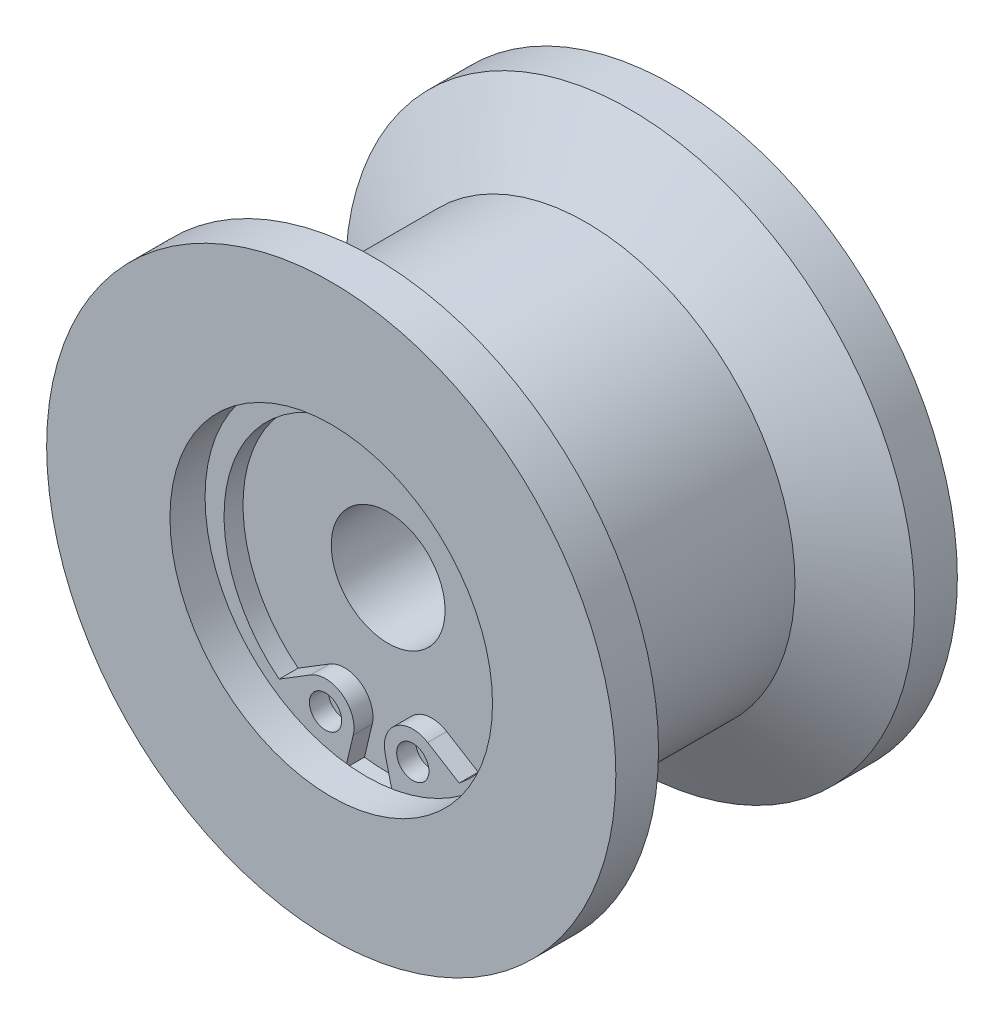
ISO-10303-21;
HEADER;
FILE_DESCRIPTION(('STEP AP214'),'2;1');
FILE_NAME('part.step','',(''),(''),'','','');
FILE_SCHEMA(('AUTOMOTIVE_DESIGN { 1 0 10303 214 1 1 1 1 }'));
ENDSEC;
DATA;
#1=APPLICATION_CONTEXT('core data for automotive mechanical design processes');
#2=APPLICATION_PROTOCOL_DEFINITION('international standard','automotive_design',2000,#1);
#3=PRODUCT_CONTEXT('',#1,'mechanical');
#4=PRODUCT('Part','Part','',(#3));
#5=PRODUCT_RELATED_PRODUCT_CATEGORY('part','',(#4));
#6=PRODUCT_DEFINITION_FORMATION('','',#4);
#7=PRODUCT_DEFINITION_CONTEXT('part definition',#1,'design');
#8=PRODUCT_DEFINITION('design','',#6,#7);
#9=PRODUCT_DEFINITION_SHAPE('','',#8);
#10=(LENGTH_UNIT() NAMED_UNIT(*) SI_UNIT(.MILLI.,.METRE.));
#11=(NAMED_UNIT(*) PLANE_ANGLE_UNIT() SI_UNIT($,.RADIAN.));
#12=(NAMED_UNIT(*) SI_UNIT($,.STERADIAN.) SOLID_ANGLE_UNIT());
#13=UNCERTAINTY_MEASURE_WITH_UNIT(LENGTH_MEASURE(1.E-05),#10,'distance_accuracy_value','');
#14=(GEOMETRIC_REPRESENTATION_CONTEXT(3) GLOBAL_UNCERTAINTY_ASSIGNED_CONTEXT((#13)) GLOBAL_UNIT_ASSIGNED_CONTEXT((#10,
#11,#12)) REPRESENTATION_CONTEXT('',''));
#15=CARTESIAN_POINT('',(0.,0.,0.));
#16=DIRECTION('',(0.,0.,1.));
#17=DIRECTION('',(1.,0.,0.));
#18=AXIS2_PLACEMENT_3D('',#15,#16,#17);
#19=CARTESIAN_POINT('',(0.,-8.5,6.0000000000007));
#20=DIRECTION('',(0.,0.,1.));
#21=DIRECTION('',(-1.,0.,0.));
#22=AXIS2_PLACEMENT_3D('',#19,#20,#21);
#23=PLANE('',#22);
#24=CARTESIAN_POINT('',(2.3,-6.75644413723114,6.0000000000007));
#25=DIRECTION('',(0.,0.,1.));
#26=DIRECTION('',(1.,0.,0.));
#27=AXIS2_PLACEMENT_3D('',#24,#25,#26);
#28=CIRCLE('',#27,0.85);
#29=CARTESIAN_POINT('',(3.15,-6.75644413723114,6.0000000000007));
#30=VERTEX_POINT('',#29);
#31=EDGE_CURVE('E121',#30,#30,#28,.T.);
#32=ORIENTED_EDGE('',*,*,#31,.T.);
#33=EDGE_LOOP('',(#32));
#34=FACE_BOUND('',#33,.T.);
#35=ADVANCED_FACE('F14',(#34),#23,.T.);
#36=CARTESIAN_POINT('',(-2.3,-6.75644413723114,6.0000000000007));
#37=DIRECTION('',(0.,0.,-1.));
#38=DIRECTION('',(1.,0.,0.));
#39=AXIS2_PLACEMENT_3D('',#36,#37,#38);
#40=CIRCLE('',#39,0.85);
#41=CARTESIAN_POINT('',(-1.45,-6.75644413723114,6.0000000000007));
#42=VERTEX_POINT('',#41);
#43=EDGE_CURVE('E134',#42,#42,#40,.T.);
#44=ORIENTED_EDGE('',*,*,#43,.F.);
#45=EDGE_LOOP('',(#44));
#46=FACE_BOUND('',#45,.T.);
#47=ADVANCED_FACE('F252',(#46),#23,.T.);
#48=CARTESIAN_POINT('',(0.,0.,-12.7286325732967));
#49=DIRECTION('',(0.,0.,-1.));
#50=DIRECTION('',(1.,0.,0.));
#51=AXIS2_PLACEMENT_3D('',#48,#49,#50);
#52=CYLINDRICAL_SURFACE('',#51,11.);
#53=CARTESIAN_POINT('',(0.,0.,4.44059892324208));
#54=DIRECTION('',(0.,0.,-1.));
#55=DIRECTION('',(1.,0.,0.));
#56=AXIS2_PLACEMENT_3D('',#53,#54,#55);
#57=CIRCLE('',#56,11.);
#58=CARTESIAN_POINT('',(11.,0.,4.44059892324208));
#59=VERTEX_POINT('',#58);
#60=EDGE_CURVE('E199',#59,#59,#57,.T.);
#61=ORIENTED_EDGE('',*,*,#60,.T.);
#62=EDGE_LOOP('',(#61));
#63=FACE_BOUND('',#62,.T.);
#64=CARTESIAN_POINT('',(0.,0.,-4.44059892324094));
#65=DIRECTION('',(0.,0.,-1.));
#66=DIRECTION('',(1.,0.,0.));
#67=AXIS2_PLACEMENT_3D('',#64,#65,#66);
#68=CIRCLE('',#67,11.);
#69=CARTESIAN_POINT('',(11.,0.,-4.44059892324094));
#70=VERTEX_POINT('',#69);
#71=EDGE_CURVE('E196',#70,#70,#68,.T.);
#72=ORIENTED_EDGE('',*,*,#71,.F.);
#73=EDGE_LOOP('',(#72));
#74=FACE_BOUND('',#73,.T.);
#75=ADVANCED_FACE('F249',(#63,#74),#52,.T.);
#76=CARTESIAN_POINT('',(0.,0.,-6.74999999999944));
#77=DIRECTION('',(0.,0.,-1.));
#78=DIRECTION('',(1.,0.,0.));
#79=AXIS2_PLACEMENT_3D('',#76,#77,#78);
#80=CONICAL_SURFACE('',#79,15.,1.0471975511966);
#81=ORIENTED_EDGE('',*,*,#71,.T.);
#82=EDGE_LOOP('',(#81));
#83=FACE_BOUND('',#82,.T.);
#84=CARTESIAN_POINT('',(0.,0.,-6.74999999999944));
#85=DIRECTION('',(0.,0.,-1.));
#86=DIRECTION('',(1.,0.,0.));
#87=AXIS2_PLACEMENT_3D('',#84,#85,#86);
#88=CIRCLE('',#87,15.);
#89=CARTESIAN_POINT('',(15.,0.,-6.74999999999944));
#90=VERTEX_POINT('',#89);
#91=EDGE_CURVE('E193',#90,#90,#88,.T.);
#92=ORIENTED_EDGE('',*,*,#91,.F.);
#93=EDGE_LOOP('',(#92));
#94=FACE_BOUND('',#93,.T.);
#95=ADVANCED_FACE('F245',(#83,#94),#80,.T.);
#96=CARTESIAN_POINT('',(0.,0.,4.44059892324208));
#97=DIRECTION('',(0.,0.,1.));
#98=DIRECTION('',(-1.,0.,0.));
#99=AXIS2_PLACEMENT_3D('',#96,#97,#98);
#100=CONICAL_SURFACE('',#99,11.,1.0471975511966);
#101=CARTESIAN_POINT('',(0.,0.,6.75000000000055));
#102=DIRECTION('',(0.,0.,-1.));
#103=DIRECTION('',(1.,0.,0.));
#104=AXIS2_PLACEMENT_3D('',#101,#102,#103);
#105=CIRCLE('',#104,15.);
#106=CARTESIAN_POINT('',(15.,0.,6.75000000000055));
#107=VERTEX_POINT('',#106);
#108=EDGE_CURVE('E202',#107,#107,#105,.T.);
#109=ORIENTED_EDGE('',*,*,#108,.T.);
#110=EDGE_LOOP('',(#109));
#111=FACE_BOUND('',#110,.T.);
#112=ORIENTED_EDGE('',*,*,#60,.F.);
#113=EDGE_LOOP('',(#112));
#114=FACE_BOUND('',#113,.T.);
#115=ADVANCED_FACE('F242',(#111,#114),#100,.T.);
#116=CARTESIAN_POINT('',(0.,0.,-12.7286325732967));
#117=DIRECTION('',(0.,0.,-1.));
#118=DIRECTION('',(1.,0.,0.));
#119=AXIS2_PLACEMENT_3D('',#116,#117,#118);
#120=CYLINDRICAL_SURFACE('',#119,15.);
#121=ORIENTED_EDGE('',*,*,#91,.T.);
#122=EDGE_LOOP('',(#121));
#123=FACE_BOUND('',#122,.T.);
#124=CARTESIAN_POINT('',(0.,0.,-9.));
#125=DIRECTION('',(0.,0.,-1.));
#126=DIRECTION('',(1.,0.,0.));
#127=AXIS2_PLACEMENT_3D('',#124,#125,#126);
#128=CIRCLE('',#127,15.);
#129=CARTESIAN_POINT('',(15.,0.,-9.));
#130=VERTEX_POINT('',#129);
#131=EDGE_CURVE('E190',#130,#130,#128,.T.);
#132=ORIENTED_EDGE('',*,*,#131,.F.);
#133=EDGE_LOOP('',(#132));
#134=FACE_BOUND('',#133,.T.);
#135=ADVANCED_FACE('F238',(#123,#134),#120,.T.);
#136=CARTESIAN_POINT('',(0.,0.,-12.7286325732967));
#137=DIRECTION('',(0.,0.,-1.));
#138=DIRECTION('',(1.,0.,0.));
#139=AXIS2_PLACEMENT_3D('',#136,#137,#138);
#140=CYLINDRICAL_SURFACE('',#139,15.);
#141=CARTESIAN_POINT('',(0.,0.,9.0000000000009));
#142=DIRECTION('',(0.,0.,-1.));
#143=DIRECTION('',(1.,0.,0.));
#144=AXIS2_PLACEMENT_3D('',#141,#142,#143);
#145=CIRCLE('',#144,15.);
#146=CARTESIAN_POINT('',(15.,0.,9.0000000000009));
#147=VERTEX_POINT('',#146);
#148=EDGE_CURVE('E205',#147,#147,#145,.T.);
#149=ORIENTED_EDGE('',*,*,#148,.T.);
#150=EDGE_LOOP('',(#149));
#151=FACE_BOUND('',#150,.T.);
#152=ORIENTED_EDGE('',*,*,#108,.F.);
#153=EDGE_LOOP('',(#152));
#154=FACE_BOUND('',#153,.T.);
#155=ADVANCED_FACE('F235',(#151,#154),#140,.T.);
#156=CARTESIAN_POINT('',(0.,-6.50000000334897,-9.));
#157=DIRECTION('',(0.,0.,-1.));
#158=DIRECTION('',(1.,0.,0.));
#159=AXIS2_PLACEMENT_3D('',#156,#157,#158);
#160=PLANE('',#159);
#161=ORIENTED_EDGE('',*,*,#131,.T.);
#162=EDGE_LOOP('',(#161));
#163=FACE_BOUND('',#162,.T.);
#164=CARTESIAN_POINT('',(0.,0.,-9.));
#165=DIRECTION('',(0.,0.,-1.));
#166=DIRECTION('',(1.,0.,0.));
#167=AXIS2_PLACEMENT_3D('',#164,#165,#166);
#168=CIRCLE('',#167,6.50000000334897);
#169=CARTESIAN_POINT('',(6.50000000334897,0.,-9.));
#170=VERTEX_POINT('',#169);
#171=EDGE_CURVE('E187',#170,#170,#168,.T.);
#172=ORIENTED_EDGE('',*,*,#171,.F.);
#173=EDGE_LOOP('',(#172));
#174=FACE_BOUND('',#173,.T.);
#175=ADVANCED_FACE('F231',(#163,#174),#160,.T.);
#176=CARTESIAN_POINT('',(0.,-8.5,9.0000000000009));
#177=DIRECTION('',(0.,0.,1.));
#178=DIRECTION('',(-1.,0.,0.));
#179=AXIS2_PLACEMENT_3D('',#176,#177,#178);
#180=PLANE('',#179);
#181=CARTESIAN_POINT('',(0.,0.,9.0000000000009));
#182=DIRECTION('',(0.,0.,-1.));
#183=DIRECTION('',(1.,0.,0.));
#184=AXIS2_PLACEMENT_3D('',#181,#182,#183);
#185=CIRCLE('',#184,8.5);
#186=CARTESIAN_POINT('',(8.5,0.,9.0000000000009));
#187=VERTEX_POINT('',#186);
#188=EDGE_CURVE('E208',#187,#187,#185,.T.);
#189=ORIENTED_EDGE('',*,*,#188,.T.);
#190=EDGE_LOOP('',(#189));
#191=FACE_BOUND('',#190,.T.);
#192=ORIENTED_EDGE('',*,*,#148,.F.);
#193=EDGE_LOOP('',(#192));
#194=FACE_BOUND('',#193,.T.);
#195=ADVANCED_FACE('F228',(#191,#194),#180,.T.);
#196=CARTESIAN_POINT('',(0.,0.,-12.7286325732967));
#197=DIRECTION('',(0.,0.,-1.));
#198=DIRECTION('',(1.,0.,0.));
#199=AXIS2_PLACEMENT_3D('',#196,#197,#198);
#200=CYLINDRICAL_SURFACE('',#199,6.50000000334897);
#201=ORIENTED_EDGE('',*,*,#171,.T.);
#202=EDGE_LOOP('',(#201));
#203=FACE_BOUND('',#202,.T.);
#204=CARTESIAN_POINT('',(0.,0.,-5.99999999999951));
#205=DIRECTION('',(0.,0.,-1.));
#206=DIRECTION('',(1.,0.,0.));
#207=AXIS2_PLACEMENT_3D('',#204,#205,#206);
#208=CIRCLE('',#207,6.50000000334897);
#209=CARTESIAN_POINT('',(6.50000000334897,0.,-5.99999999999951));
#210=VERTEX_POINT('',#209);
#211=EDGE_CURVE('E184',#210,#210,#208,.T.);
#212=ORIENTED_EDGE('',*,*,#211,.F.);
#213=EDGE_LOOP('',(#212));
#214=FACE_BOUND('',#213,.T.);
#215=ADVANCED_FACE('F224',(#203,#214),#200,.F.);
#216=CARTESIAN_POINT('',(0.,0.,-12.7286325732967));
#217=DIRECTION('',(0.,0.,-1.));
#218=DIRECTION('',(1.,0.,0.));
#219=AXIS2_PLACEMENT_3D('',#216,#217,#218);
#220=CYLINDRICAL_SURFACE('',#219,8.5);
#221=CARTESIAN_POINT('',(0.,0.,7.1500000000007));
#222=DIRECTION('',(0.,0.,1.));
#223=DIRECTION('',(1.,0.,0.));
#224=AXIS2_PLACEMENT_3D('',#221,#222,#223);
#225=CIRCLE('',#224,8.5);
#226=CARTESIAN_POINT('',(8.5,0.,7.1500000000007));
#227=VERTEX_POINT('',#226);
#228=EDGE_CURVE('E177',#227,#227,#225,.T.);
#229=ORIENTED_EDGE('',*,*,#228,.F.);
#230=EDGE_LOOP('',(#229));
#231=FACE_BOUND('',#230,.T.);
#232=ORIENTED_EDGE('',*,*,#188,.F.);
#233=EDGE_LOOP('',(#232));
#234=FACE_BOUND('',#233,.T.);
#235=ADVANCED_FACE('F220',(#231,#234),#220,.F.);
#236=CARTESIAN_POINT('',(0.,-6.50000000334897,-5.99999999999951));
#237=DIRECTION('',(0.,0.,-1.));
#238=DIRECTION('',(1.,0.,0.));
#239=AXIS2_PLACEMENT_3D('',#236,#237,#238);
#240=PLANE('',#239);
#241=ORIENTED_EDGE('',*,*,#211,.T.);
#242=EDGE_LOOP('',(#241));
#243=FACE_BOUND('',#242,.T.);
#244=CARTESIAN_POINT('',(0.,0.,-5.99999999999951));
#245=DIRECTION('',(0.,0.,-1.));
#246=DIRECTION('',(1.,0.,0.));
#247=AXIS2_PLACEMENT_3D('',#244,#245,#246);
#248=CIRCLE('',#247,3.00000000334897);
#249=CARTESIAN_POINT('',(3.00000000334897,0.,-5.99999999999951));
#250=VERTEX_POINT('',#249);
#251=EDGE_CURVE('E181',#250,#250,#248,.T.);
#252=ORIENTED_EDGE('',*,*,#251,.F.);
#253=EDGE_LOOP('',(#252));
#254=FACE_BOUND('',#253,.T.);
#255=ADVANCED_FACE('F223',(#243,#254),#240,.T.);
#256=CARTESIAN_POINT('',(0.,0.,7.1500000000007));
#257=DIRECTION('',(0.,0.,1.));
#258=DIRECTION('',(1.,0.,0.));
#259=AXIS2_PLACEMENT_3D('',#256,#257,#258);
#260=PLANE('',#259);
#261=ORIENTED_EDGE('',*,*,#228,.T.);
#262=EDGE_LOOP('',(#261));
#263=FACE_BOUND('',#262,.T.);
#264=CARTESIAN_POINT('',(0.,0.,7.1500000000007));
#265=DIRECTION('',(0.,0.,1.));
#266=DIRECTION('',(1.,0.,0.));
#267=AXIS2_PLACEMENT_3D('',#264,#265,#266);
#268=CIRCLE('',#267,8.9);
#269=CARTESIAN_POINT('',(8.9,0.,7.1500000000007));
#270=VERTEX_POINT('',#269);
#271=EDGE_CURVE('E174',#270,#270,#268,.T.);
#272=ORIENTED_EDGE('',*,*,#271,.F.);
#273=EDGE_LOOP('',(#272));
#274=FACE_BOUND('',#273,.T.);
#275=ADVANCED_FACE('F217',(#263,#274),#260,.F.);
#276=CARTESIAN_POINT('',(0.,0.,7.1500000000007));
#277=DIRECTION('',(0.,0.,-1.));
#278=DIRECTION('',(-1.,0.,0.));
#279=AXIS2_PLACEMENT_3D('',#276,#277,#278);
#280=CYLINDRICAL_SURFACE('',#279,8.9);
#281=ORIENTED_EDGE('',*,*,#271,.T.);
#282=EDGE_LOOP('',(#281));
#283=FACE_BOUND('',#282,.T.);
#284=DIRECTION('',(0.,0.,-1.));
#285=VECTOR('',#284,1.);
#286=CARTESIAN_POINT('',(1.24703201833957,-8.81220240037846,7.1500000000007));
#287=LINE('',#286,#285);
#288=CARTESIAN_POINT('',(1.24703201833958,-8.81220240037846,6.0000000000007));
#289=VERTEX_POINT('',#288);
#290=CARTESIAN_POINT('',(1.24703201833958,-8.81220240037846,7.0000000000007));
#291=VERTEX_POINT('',#290);
#292=EDGE_CURVE('E18',#289,#291,#287,.F.);
#293=ORIENTED_EDGE('',*,*,#292,.F.);
#294=CARTESIAN_POINT('',(0.,0.,6.0000000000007));
#295=DIRECTION('',(0.,0.,1.));
#296=DIRECTION('',(1.,0.,0.));
#297=AXIS2_PLACEMENT_3D('',#294,#295,#296);
#298=CIRCLE('',#297,8.9);
#299=CARTESIAN_POINT('',(-1.24703201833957,-8.81220240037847,6.0000000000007));
#300=VERTEX_POINT('',#299);
#301=EDGE_CURVE('E178',#300,#289,#298,.T.);
#302=ORIENTED_EDGE('',*,*,#301,.F.);
#303=DIRECTION('',(0.,0.,-1.));
#304=VECTOR('',#303,1.);
#305=CARTESIAN_POINT('',(-1.24703201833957,-8.81220240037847,7.1500000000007));
#306=LINE('',#305,#304);
#307=CARTESIAN_POINT('',(-1.24703201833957,-8.81220240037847,7.0000000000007));
#308=VERTEX_POINT('',#307);
#309=EDGE_CURVE('E116',#308,#300,#306,.T.);
#310=ORIENTED_EDGE('',*,*,#309,.F.);
#311=CARTESIAN_POINT('',(0.,0.,7.0000000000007));
#312=DIRECTION('',(0.,0.,-1.));
#313=DIRECTION('',(-1.,0.,0.));
#314=AXIS2_PLACEMENT_3D('',#311,#312,#313);
#315=CIRCLE('',#314,8.9);
#316=EDGE_CURVE('E9',#291,#308,#315,.F.);
#317=ORIENTED_EDGE('',*,*,#316,.F.);
#318=EDGE_LOOP('',(#293,#302,#310,#317));
#319=FACE_BOUND('',#318,.T.);
#320=ADVANCED_FACE('F283',(#283,#319),#280,.F.);
#321=CARTESIAN_POINT('',(0.,0.,-12.7286325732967));
#322=DIRECTION('',(0.,0.,-1.));
#323=DIRECTION('',(1.,0.,0.));
#324=AXIS2_PLACEMENT_3D('',#321,#322,#323);
#325=CYLINDRICAL_SURFACE('',#324,3.00000000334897);
#326=ORIENTED_EDGE('',*,*,#251,.T.);
#327=EDGE_LOOP('',(#326));
#328=FACE_BOUND('',#327,.T.);
#329=CARTESIAN_POINT('',(0.,0.,6.0000000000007));
#330=DIRECTION('',(0.,0.,-1.));
#331=DIRECTION('',(1.,0.,0.));
#332=AXIS2_PLACEMENT_3D('',#329,#330,#331);
#333=CIRCLE('',#332,3.00000000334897);
#334=CARTESIAN_POINT('',(3.00000000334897,0.,6.0000000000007));
#335=VERTEX_POINT('',#334);
#336=EDGE_CURVE('E211',#335,#335,#333,.T.);
#337=ORIENTED_EDGE('',*,*,#336,.F.);
#338=EDGE_LOOP('',(#337));
#339=FACE_BOUND('',#338,.T.);
#340=ADVANCED_FACE('F16',(#328,#339),#325,.F.);
#341=ORIENTED_EDGE('',*,*,#336,.T.);
#342=EDGE_LOOP('',(#341));
#343=FACE_BOUND('',#342,.T.);
#344=DIRECTION('',(0.231349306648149,-0.972870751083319,0.));
#345=VECTOR('',#344,1.);
#346=CARTESIAN_POINT('',(0.840693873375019,-7.10346809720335,6.0000000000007));
#347=LINE('',#346,#345);
#348=CARTESIAN_POINT('',(0.840693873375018,-7.10346809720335,6.0000000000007));
#349=VERTEX_POINT('',#348);
#350=EDGE_CURVE('E34',#349,#289,#347,.T.);
#351=ORIENTED_EDGE('',*,*,#350,.F.);
#352=CARTESIAN_POINT('',(2.3,-6.75644413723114,6.0000000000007));
#353=DIRECTION('',(0.,0.,1.));
#354=DIRECTION('',(1.,0.,0.));
#355=AXIS2_PLACEMENT_3D('',#352,#353,#354);
#356=CIRCLE('',#355,1.5);
#357=CARTESIAN_POINT('',(3.08650226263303,-5.47917588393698,6.0000000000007));
#358=VERTEX_POINT('',#357);
#359=EDGE_CURVE('E161',#358,#349,#356,.T.);
#360=ORIENTED_EDGE('',*,*,#359,.F.);
#361=DIRECTION('',(-0.851512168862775,0.524334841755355,0.));
#362=VECTOR('',#361,1.);
#363=CARTESIAN_POINT('',(3.08650226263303,-5.47917588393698,6.0000000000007));
#364=LINE('',#363,#362);
#365=CARTESIAN_POINT('',(4.74513893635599,-6.50051301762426,6.0000000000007));
#366=VERTEX_POINT('',#365);
#367=EDGE_CURVE('E151',#366,#358,#364,.T.);
#368=ORIENTED_EDGE('',*,*,#367,.F.);
#369=CARTESIAN_POINT('',(0.,-0.5,6.0000000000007));
#370=DIRECTION('',(0.,0.,-1.));
#371=DIRECTION('',(0.,-1.,0.));
#372=AXIS2_PLACEMENT_3D('',#369,#370,#371);
#373=CIRCLE('',#372,7.65);
#374=CARTESIAN_POINT('',(-4.74513893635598,-6.50051301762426,6.0000000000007));
#375=VERTEX_POINT('',#374);
#376=EDGE_CURVE('E111',#375,#366,#373,.T.);
#377=ORIENTED_EDGE('',*,*,#376,.F.);
#378=DIRECTION('',(-0.851512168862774,-0.524334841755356,0.));
#379=VECTOR('',#378,1.);
#380=CARTESIAN_POINT('',(-3.08650226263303,-5.47917588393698,6.0000000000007));
#381=LINE('',#380,#379);
#382=CARTESIAN_POINT('',(-3.08650226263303,-5.47917588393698,6.0000000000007));
#383=VERTEX_POINT('',#382);
#384=EDGE_CURVE('E108',#383,#375,#381,.T.);
#385=ORIENTED_EDGE('',*,*,#384,.F.);
#386=CARTESIAN_POINT('',(-2.3,-6.75644413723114,6.0000000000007));
#387=DIRECTION('',(0.,0.,1.));
#388=DIRECTION('',(-1.,0.,0.));
#389=AXIS2_PLACEMENT_3D('',#386,#387,#388);
#390=CIRCLE('',#389,1.5);
#391=CARTESIAN_POINT('',(-0.84069387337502,-7.10346809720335,6.0000000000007));
#392=VERTEX_POINT('',#391);
#393=EDGE_CURVE('E94',#392,#383,#390,.T.);
#394=ORIENTED_EDGE('',*,*,#393,.F.);
#395=DIRECTION('',(0.231349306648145,0.97287075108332,0.));
#396=VECTOR('',#395,1.);
#397=CARTESIAN_POINT('',(-0.84069387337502,-7.10346809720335,6.0000000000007));
#398=LINE('',#397,#396);
#399=EDGE_CURVE('E105',#300,#392,#398,.T.);
#400=ORIENTED_EDGE('',*,*,#399,.F.);
#401=ORIENTED_EDGE('',*,*,#301,.T.);
#402=EDGE_LOOP('',(#351,#360,#368,#377,#385,#394,#400,#401));
#403=FACE_BOUND('',#402,.T.);
#404=ADVANCED_FACE('F109',(#343,#403),#23,.T.);
#405=CARTESIAN_POINT('',(0.,-0.5,7.0000000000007));
#406=DIRECTION('',(0.,0.,1.));
#407=DIRECTION('',(-1.,0.,0.));
#408=AXIS2_PLACEMENT_3D('',#405,#406,#407);
#409=CYLINDRICAL_SURFACE('',#408,7.65);
#410=ORIENTED_EDGE('',*,*,#376,.T.);
#411=DIRECTION('',(0.,0.,-1.));
#412=VECTOR('',#411,1.);
#413=CARTESIAN_POINT('',(4.74513893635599,-6.50051301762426,7.0000000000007));
#414=LINE('',#413,#412);
#415=CARTESIAN_POINT('',(4.74513893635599,-6.50051301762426,7.0000000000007));
#416=VERTEX_POINT('',#415);
#417=EDGE_CURVE('E137',#416,#366,#414,.T.);
#418=ORIENTED_EDGE('',*,*,#417,.F.);
#419=CARTESIAN_POINT('',(0.,-0.5,7.0000000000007));
#420=DIRECTION('',(0.,0.,-1.));
#421=DIRECTION('',(0.,-1.,0.));
#422=AXIS2_PLACEMENT_3D('',#419,#420,#421);
#423=CIRCLE('',#422,7.65);
#424=CARTESIAN_POINT('',(-4.74513893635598,-6.50051301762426,7.0000000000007));
#425=VERTEX_POINT('',#424);
#426=EDGE_CURVE('E138',#425,#416,#423,.T.);
#427=ORIENTED_EDGE('',*,*,#426,.F.);
#428=DIRECTION('',(0.,0.,-1.));
#429=VECTOR('',#428,1.);
#430=CARTESIAN_POINT('',(-4.74513893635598,-6.50051301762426,7.0000000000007));
#431=LINE('',#430,#429);
#432=EDGE_CURVE('E166',#425,#375,#431,.T.);
#433=ORIENTED_EDGE('',*,*,#432,.T.);
#434=EDGE_LOOP('',(#410,#418,#427,#433));
#435=FACE_BOUND('',#434,.T.);
#436=ADVANCED_FACE('F287',(#435),#409,.F.);
#437=CARTESIAN_POINT('',(3.08650226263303,-5.47917588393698,7.0000000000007));
#438=DIRECTION('',(-0.524334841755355,-0.851512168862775,0.));
#439=DIRECTION('',(-0.851512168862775,0.524334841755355,0.));
#440=AXIS2_PLACEMENT_3D('',#437,#438,#439);
#441=PLANE('',#440);
#442=ORIENTED_EDGE('',*,*,#367,.T.);
#443=DIRECTION('',(0.,0.,-1.));
#444=VECTOR('',#443,1.);
#445=CARTESIAN_POINT('',(3.08650226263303,-5.47917588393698,7.0000000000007));
#446=LINE('',#445,#444);
#447=CARTESIAN_POINT('',(3.08650226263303,-5.47917588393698,7.0000000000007));
#448=VERTEX_POINT('',#447);
#449=EDGE_CURVE('E146',#448,#358,#446,.T.);
#450=ORIENTED_EDGE('',*,*,#449,.F.);
#451=DIRECTION('',(-0.851512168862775,0.524334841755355,0.));
#452=VECTOR('',#451,1.);
#453=CARTESIAN_POINT('',(3.08650226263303,-5.47917588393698,7.0000000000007));
#454=LINE('',#453,#452);
#455=EDGE_CURVE('E156',#416,#448,#454,.T.);
#456=ORIENTED_EDGE('',*,*,#455,.F.);
#457=ORIENTED_EDGE('',*,*,#417,.T.);
#458=EDGE_LOOP('',(#442,#450,#456,#457));
#459=FACE_BOUND('',#458,.T.);
#460=ADVANCED_FACE('F292',(#459),#441,.F.);
#461=CARTESIAN_POINT('',(2.3,-6.75644413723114,7.0000000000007));
#462=DIRECTION('',(0.,0.,1.));
#463=DIRECTION('',(-1.,0.,0.));
#464=AXIS2_PLACEMENT_3D('',#461,#462,#463);
#465=CYLINDRICAL_SURFACE('',#464,1.5);
#466=ORIENTED_EDGE('',*,*,#359,.T.);
#467=DIRECTION('',(0.,0.,-1.));
#468=VECTOR('',#467,1.);
#469=CARTESIAN_POINT('',(0.840693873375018,-7.10346809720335,7.0000000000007));
#470=LINE('',#469,#468);
#471=CARTESIAN_POINT('',(0.840693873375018,-7.10346809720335,7.0000000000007));
#472=VERTEX_POINT('',#471);
#473=EDGE_CURVE('E147',#472,#349,#470,.T.);
#474=ORIENTED_EDGE('',*,*,#473,.F.);
#475=CARTESIAN_POINT('',(2.3,-6.75644413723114,7.0000000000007));
#476=DIRECTION('',(0.,0.,1.));
#477=DIRECTION('',(1.,0.,0.));
#478=AXIS2_PLACEMENT_3D('',#475,#476,#477);
#479=CIRCLE('',#478,1.5);
#480=EDGE_CURVE('E152',#448,#472,#479,.T.);
#481=ORIENTED_EDGE('',*,*,#480,.F.);
#482=ORIENTED_EDGE('',*,*,#449,.T.);
#483=EDGE_LOOP('',(#466,#474,#481,#482));
#484=FACE_BOUND('',#483,.T.);
#485=ADVANCED_FACE('F337',(#484),#465,.T.);
#486=CARTESIAN_POINT('',(-0.84069387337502,-7.10346809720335,7.0000000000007));
#487=DIRECTION('',(-0.97287075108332,0.231349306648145,0.));
#488=DIRECTION('',(0.,0.,1.));
#489=AXIS2_PLACEMENT_3D('',#486,#487,#488);
#490=PLANE('',#489);
#491=DIRECTION('',(0.231349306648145,0.97287075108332,0.));
#492=VECTOR('',#491,1.);
#493=CARTESIAN_POINT('',(-0.84069387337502,-7.10346809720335,7.0000000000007));
#494=LINE('',#493,#492);
#495=CARTESIAN_POINT('',(-0.84069387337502,-7.10346809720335,7.0000000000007));
#496=VERTEX_POINT('',#495);
#497=EDGE_CURVE('E142',#308,#496,#494,.T.);
#498=ORIENTED_EDGE('',*,*,#497,.F.);
#499=ORIENTED_EDGE('',*,*,#309,.T.);
#500=ORIENTED_EDGE('',*,*,#399,.T.);
#501=DIRECTION('',(0.,0.,-1.));
#502=VECTOR('',#501,1.);
#503=CARTESIAN_POINT('',(-0.84069387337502,-7.10346809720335,7.0000000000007));
#504=LINE('',#503,#502);
#505=EDGE_CURVE('E102',#496,#392,#504,.T.);
#506=ORIENTED_EDGE('',*,*,#505,.F.);
#507=EDGE_LOOP('',(#498,#499,#500,#506));
#508=FACE_BOUND('',#507,.T.);
#509=ADVANCED_FACE('F353',(#508),#490,.F.);
#510=CARTESIAN_POINT('',(0.,-0.5,7.0000000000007));
#511=DIRECTION('',(0.,0.,-1.));
#512=DIRECTION('',(0.,-1.,0.));
#513=AXIS2_PLACEMENT_3D('',#510,#511,#512);
#514=PLANE('',#513);
#515=CARTESIAN_POINT('',(-2.3,-6.75644413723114,7.0000000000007));
#516=DIRECTION('',(0.,0.,-1.));
#517=DIRECTION('',(1.,0.,0.));
#518=AXIS2_PLACEMENT_3D('',#515,#516,#517);
#519=CIRCLE('',#518,0.85);
#520=CARTESIAN_POINT('',(-1.45,-6.75644413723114,7.0000000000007));
#521=VERTEX_POINT('',#520);
#522=EDGE_CURVE('E143',#521,#521,#519,.T.);
#523=ORIENTED_EDGE('',*,*,#522,.T.);
#524=EDGE_LOOP('',(#523));
#525=FACE_BOUND('',#524,.T.);
#526=CARTESIAN_POINT('',(2.3,-6.75644413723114,7.0000000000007));
#527=DIRECTION('',(0.,0.,1.));
#528=DIRECTION('',(1.,0.,0.));
#529=AXIS2_PLACEMENT_3D('',#526,#527,#528);
#530=CIRCLE('',#529,0.85);
#531=CARTESIAN_POINT('',(3.15,-6.75644413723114,7.0000000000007));
#532=VERTEX_POINT('',#531);
#533=EDGE_CURVE('E131',#532,#532,#530,.T.);
#534=ORIENTED_EDGE('',*,*,#533,.F.);
#535=EDGE_LOOP('',(#534));
#536=FACE_BOUND('',#535,.T.);
#537=DIRECTION('',(0.231349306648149,-0.972870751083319,0.));
#538=VECTOR('',#537,1.);
#539=CARTESIAN_POINT('',(0.840693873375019,-7.10346809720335,7.0000000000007));
#540=LINE('',#539,#538);
#541=EDGE_CURVE('E157',#472,#291,#540,.T.);
#542=ORIENTED_EDGE('',*,*,#541,.T.);
#543=ORIENTED_EDGE('',*,*,#316,.T.);
#544=ORIENTED_EDGE('',*,*,#497,.T.);
#545=CARTESIAN_POINT('',(-2.3,-6.75644413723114,7.0000000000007));
#546=DIRECTION('',(0.,0.,1.));
#547=DIRECTION('',(-1.,0.,0.));
#548=AXIS2_PLACEMENT_3D('',#545,#546,#547);
#549=CIRCLE('',#548,1.5);
#550=CARTESIAN_POINT('',(-3.08650226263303,-5.47917588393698,7.0000000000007));
#551=VERTEX_POINT('',#550);
#552=EDGE_CURVE('E139',#496,#551,#549,.T.);
#553=ORIENTED_EDGE('',*,*,#552,.T.);
#554=DIRECTION('',(-0.851512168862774,-0.524334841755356,0.));
#555=VECTOR('',#554,1.);
#556=CARTESIAN_POINT('',(-3.08650226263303,-5.47917588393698,7.0000000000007));
#557=LINE('',#556,#555);
#558=EDGE_CURVE('E119',#551,#425,#557,.T.);
#559=ORIENTED_EDGE('',*,*,#558,.T.);
#560=ORIENTED_EDGE('',*,*,#426,.T.);
#561=ORIENTED_EDGE('',*,*,#455,.T.);
#562=ORIENTED_EDGE('',*,*,#480,.T.);
#563=EDGE_LOOP('',(#542,#543,#544,#553,#559,#560,#561,#562));
#564=FACE_BOUND('',#563,.T.);
#565=ADVANCED_FACE('F308',(#525,#536,#564),#514,.F.);
#566=CARTESIAN_POINT('',(2.3,-6.75644413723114,7.0000000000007));
#567=DIRECTION('',(0.,0.,1.));
#568=DIRECTION('',(-1.,0.,0.));
#569=AXIS2_PLACEMENT_3D('',#566,#567,#568);
#570=CYLINDRICAL_SURFACE('',#569,0.85);
#571=ORIENTED_EDGE('',*,*,#31,.F.);
#572=EDGE_LOOP('',(#571));
#573=FACE_BOUND('',#572,.T.);
#574=ORIENTED_EDGE('',*,*,#533,.T.);
#575=EDGE_LOOP('',(#574));
#576=FACE_BOUND('',#575,.T.);
#577=ADVANCED_FACE('F304',(#573,#576),#570,.F.);
#578=CARTESIAN_POINT('',(-2.3,-6.75644413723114,7.0000000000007));
#579=DIRECTION('',(0.,0.,1.));
#580=DIRECTION('',(-1.,0.,0.));
#581=AXIS2_PLACEMENT_3D('',#578,#579,#580);
#582=CYLINDRICAL_SURFACE('',#581,0.85);
#583=ORIENTED_EDGE('',*,*,#43,.T.);
#584=EDGE_LOOP('',(#583));
#585=FACE_BOUND('',#584,.T.);
#586=ORIENTED_EDGE('',*,*,#522,.F.);
#587=EDGE_LOOP('',(#586));
#588=FACE_BOUND('',#587,.T.);
#589=ADVANCED_FACE('F307',(#585,#588),#582,.F.);
#590=CARTESIAN_POINT('',(-3.08650226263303,-5.47917588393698,7.0000000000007));
#591=DIRECTION('',(0.524334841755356,-0.851512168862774,0.));
#592=DIRECTION('',(0.,0.,-1.));
#593=AXIS2_PLACEMENT_3D('',#590,#591,#592);
#594=PLANE('',#593);
#595=ORIENTED_EDGE('',*,*,#384,.T.);
#596=ORIENTED_EDGE('',*,*,#432,.F.);
#597=ORIENTED_EDGE('',*,*,#558,.F.);
#598=DIRECTION('',(0.,0.,-1.));
#599=VECTOR('',#598,1.);
#600=CARTESIAN_POINT('',(-3.08650226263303,-5.47917588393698,7.0000000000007));
#601=LINE('',#600,#599);
#602=EDGE_CURVE('E99',#551,#383,#601,.T.);
#603=ORIENTED_EDGE('',*,*,#602,.T.);
#604=EDGE_LOOP('',(#595,#596,#597,#603));
#605=FACE_BOUND('',#604,.T.);
#606=ADVANCED_FACE('F118',(#605),#594,.F.);
#607=CARTESIAN_POINT('',(-2.3,-6.75644413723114,7.0000000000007));
#608=DIRECTION('',(0.,0.,1.));
#609=DIRECTION('',(-1.,0.,0.));
#610=AXIS2_PLACEMENT_3D('',#607,#608,#609);
#611=CYLINDRICAL_SURFACE('',#610,1.5);
#612=ORIENTED_EDGE('',*,*,#393,.T.);
#613=ORIENTED_EDGE('',*,*,#602,.F.);
#614=ORIENTED_EDGE('',*,*,#552,.F.);
#615=ORIENTED_EDGE('',*,*,#505,.T.);
#616=EDGE_LOOP('',(#612,#613,#614,#615));
#617=FACE_BOUND('',#616,.T.);
#618=ADVANCED_FACE('F96',(#617),#611,.T.);
#619=CARTESIAN_POINT('',(0.840693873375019,-7.10346809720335,7.0000000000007));
#620=DIRECTION('',(0.972870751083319,0.231349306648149,0.));
#621=DIRECTION('',(0.,0.,-1.));
#622=AXIS2_PLACEMENT_3D('',#619,#620,#621);
#623=PLANE('',#622);
#624=ORIENTED_EDGE('',*,*,#350,.T.);
#625=ORIENTED_EDGE('',*,*,#292,.T.);
#626=ORIENTED_EDGE('',*,*,#541,.F.);
#627=ORIENTED_EDGE('',*,*,#473,.T.);
#628=EDGE_LOOP('',(#624,#625,#626,#627));
#629=FACE_BOUND('',#628,.T.);
#630=ADVANCED_FACE('F297',(#629),#623,.F.);
#631=CLOSED_SHELL('',(#35,#47,#75,#95,#115,#135,#155,#175,#195,#215,#235,#255,#275,#320,#340,
#404,#436,#460,#485,#509,#565,#577,#589,#606,#618,#630));
#632=MANIFOLD_SOLID_BREP('B1',#631);
#633=ADVANCED_BREP_SHAPE_REPRESENTATION('',(#18,#632),#14);
#634=SHAPE_DEFINITION_REPRESENTATION(#9,#633);
ENDSEC;
END-ISO-10303-21;
